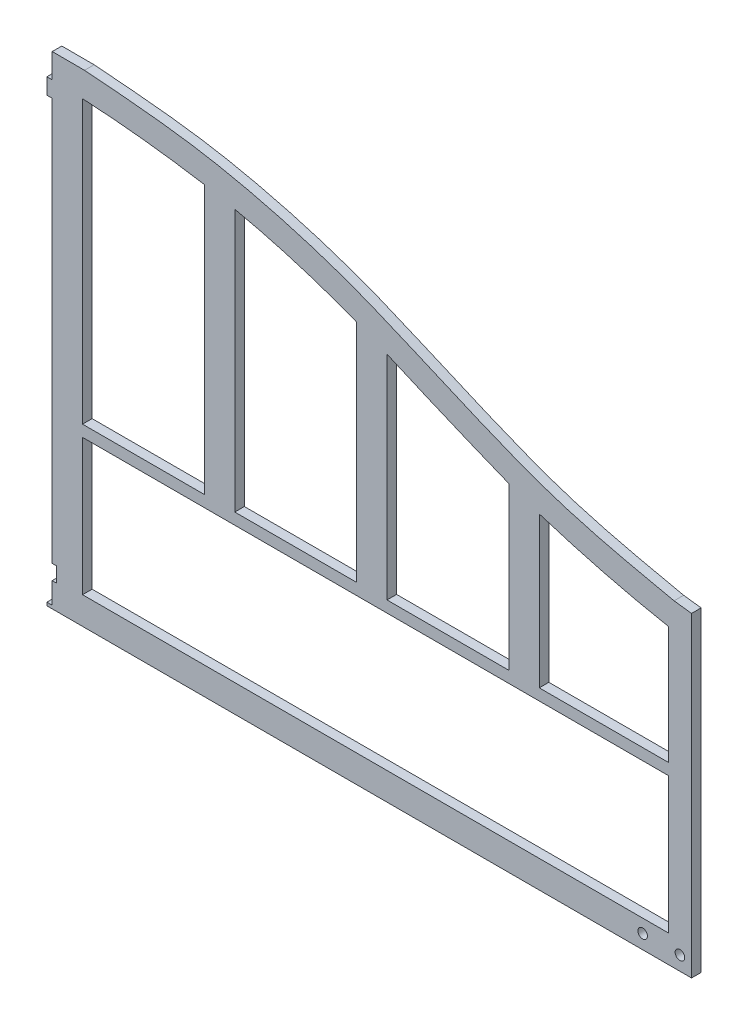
from build123d import *

# Parameters (mm, degrees)
ESQUISSE1_R      = 4.5
ESQUISSE1_W      = 550.14
ESQUISSE1_H      = 127.9
EXTRUSION1_DEPTH = 9


with BuildPart() as part:
    # Esquisse1 → Extrusion1 (new body)
    with BuildSketch(Plane.XY):
        with BuildLine():
            Line((0, 0), (605, 0))
            Line((605, 0), (605, 296.33))
            Line((605, 296.33), (588.61912312, 298.376385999))
            add(Edge.make_bspline(
                [(35.329073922, 452.927291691), (41.322386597, 452.460296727), (53.282374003, 451.528423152), (71.375474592, 450.032262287), (89.542985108, 448.355525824), (107.78933849, 446.408441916), (126.097309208, 444.099034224), (144.450561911, 441.341870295), (162.845786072, 438.018110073), (180.969171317, 434.214658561), (198.959310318, 430.038741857), (222.870324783, 423.931585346), (246.589569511, 417.010976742), (270.069351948, 409.235694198), (287.528836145, 402.97754257), (304.875430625, 396.247093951), (321.820581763, 389.209175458), (338.433024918, 382.117843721), (360.488388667, 372.606028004), (387.848792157, 360.754876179), (415.100784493, 349.304912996), (436.91722319, 340.597353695), (453.312778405, 334.331172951), (469.547899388, 328.540459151), (491.334979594, 321.56697565), (519.267646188, 313.909682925), (547.870565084, 307.218352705), (571.057947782, 302.137859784), (582.77467448, 299.628210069), (588.61912312, 298.376385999)],
                knots=[0, 0, 0, 0, 0.03125, 0.0625, 0.09375, 0.125, 0.15625, 0.1875, 0.21875, 0.25, 0.28125, 0.3125, 0.375, 0.40625, 0.4375, 0.46875, 0.5, 0.53125, 0.5625, 0.625, 0.6875, 0.71875, 0.75, 0.78125, 0.8125, 0.875, 0.9375, 0.96875, 1, 1, 1, 1], degree=3))
            Line((35.329073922, 452.927291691), (5, 453))
            Line((5, 453), (5, 430))
            Line((5, 430), (0, 430))
            Line((0, 430), (0, 415))
            Line((0, 415), (5, 415))
            Line((5, 415), (5, 37))
            Line((5, 37), (9, 37))
            Line((9, 37), (9, 23))
            Line((9, 23), (5, 23))
            Line((5, 23), (5, 3))
            Line((5, 3), (0, 3))
            Line((0, 3), (0, 0))
        make_face()
        with Locations((594.14, 13.26)):
            Circle(ESQUISSE1_R, mode=Mode.SUBTRACT)
        with Locations((559.14, 13.26)):
            Circle(ESQUISSE1_R, mode=Mode.SUBTRACT)
        with Locations((308.53, 89.71)):
            Rectangle(ESQUISSE1_W, ESQUISSE1_H, mode=Mode.SUBTRACT)
        with BuildLine():
            Line((33.46, 164.37), (147.88, 164.37))
            Line((147.88, 164.37), (147.88, 416.25))
            ThreePointArc((147.88, 416.25), (90.846761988, 424.188783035), (33.46, 428.94))
            Line((33.46, 428.94), (33.46, 164.37))
        make_face(mode=Mode.SUBTRACT)
        with BuildLine():
            Line((176.34, 164.37), (290.76, 164.37))
            Line((290.76, 164.37), (290.76, 375.89))
            ThreePointArc((290.76, 375.89), (234.252507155, 395.530463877), (176.34, 410.53))
            Line((176.34, 410.53), (176.34, 164.37))
        make_face(mode=Mode.SUBTRACT)
        with BuildLine():
            Line((319.22, 164.37), (433.64, 164.37))
            Line((433.64, 164.37), (433.64, 316.11))
            ThreePointArc((433.64, 316.11), (376.219157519, 339.627822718), (319.22, 364.15))
            Line((319.22, 364.15), (319.22, 164.37))
        make_face(mode=Mode.SUBTRACT)
        with BuildLine():
            Line((462.1, 164.37), (583.58, 164.37))
            Line((583.58, 164.37), (583.58, 274.85))
            ThreePointArc((583.58, 274.85), (522.367606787, 288.448438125), (462.1, 305.76))
            Line((462.1, 305.76), (462.1, 164.37))
        make_face(mode=Mode.SUBTRACT)
    extrude(amount=EXTRUSION1_DEPTH)


solid = part.part
